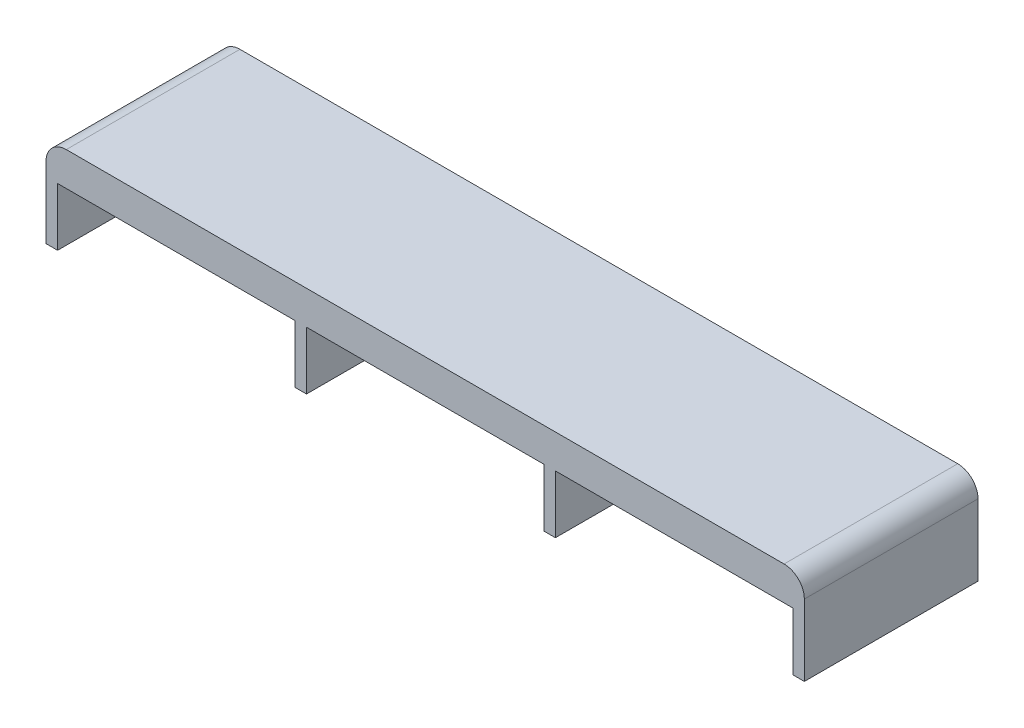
ISO-10303-21;
HEADER;
FILE_DESCRIPTION(('STEP AP214'),'2;1');
FILE_NAME('part.step','',(''),(''),'','','');
FILE_SCHEMA(('AUTOMOTIVE_DESIGN { 1 0 10303 214 1 1 1 1 }'));
ENDSEC;
DATA;
#1=APPLICATION_CONTEXT('core data for automotive mechanical design processes');
#2=APPLICATION_PROTOCOL_DEFINITION('international standard','automotive_design',2000,#1);
#3=PRODUCT_CONTEXT('',#1,'mechanical');
#4=PRODUCT('Part','Part','',(#3));
#5=PRODUCT_RELATED_PRODUCT_CATEGORY('part','',(#4));
#6=PRODUCT_DEFINITION_FORMATION('','',#4);
#7=PRODUCT_DEFINITION_CONTEXT('part definition',#1,'design');
#8=PRODUCT_DEFINITION('design','',#6,#7);
#9=PRODUCT_DEFINITION_SHAPE('','',#8);
#10=(LENGTH_UNIT() NAMED_UNIT(*) SI_UNIT(.MILLI.,.METRE.));
#11=(NAMED_UNIT(*) PLANE_ANGLE_UNIT() SI_UNIT($,.RADIAN.));
#12=(NAMED_UNIT(*) SI_UNIT($,.STERADIAN.) SOLID_ANGLE_UNIT());
#13=UNCERTAINTY_MEASURE_WITH_UNIT(LENGTH_MEASURE(1.E-05),#10,'distance_accuracy_value','');
#14=(GEOMETRIC_REPRESENTATION_CONTEXT(3) GLOBAL_UNCERTAINTY_ASSIGNED_CONTEXT((#13)) GLOBAL_UNIT_ASSIGNED_CONTEXT((#10,
#11,#12)) REPRESENTATION_CONTEXT('',''));
#15=CARTESIAN_POINT('',(0.,0.,0.));
#16=DIRECTION('',(0.,0.,1.));
#17=DIRECTION('',(1.,0.,0.));
#18=AXIS2_PLACEMENT_3D('',#15,#16,#17);
#19=CARTESIAN_POINT('',(-655.,-883.388792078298,150.));
#20=DIRECTION('',(-1.,0.,0.));
#21=DIRECTION('',(0.,-1.,0.));
#22=AXIS2_PLACEMENT_3D('',#19,#20,#21);
#23=PLANE('',#22);
#24=DIRECTION('',(0.,1.,0.));
#25=VECTOR('',#24,1.);
#26=CARTESIAN_POINT('',(-655.,-883.388792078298,150.));
#27=LINE('',#26,#25);
#28=CARTESIAN_POINT('',(-655.,-99.9999999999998,150.));
#29=VERTEX_POINT('',#28);
#30=CARTESIAN_POINT('',(-655.,23.2438816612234,150.));
#31=VERTEX_POINT('',#30);
#32=EDGE_CURVE('E166',#29,#31,#27,.T.);
#33=ORIENTED_EDGE('',*,*,#32,.T.);
#34=DIRECTION('',(0.,0.,-1.));
#35=VECTOR('',#34,1.);
#36=CARTESIAN_POINT('',(-655.,23.2438816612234,150.));
#37=LINE('',#36,#35);
#38=CARTESIAN_POINT('',(-655.,23.2438816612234,-150.));
#39=VERTEX_POINT('',#38);
#40=EDGE_CURVE('E172',#31,#39,#37,.T.);
#41=ORIENTED_EDGE('',*,*,#40,.T.);
#42=DIRECTION('',(0.,1.,0.));
#43=VECTOR('',#42,1.);
#44=CARTESIAN_POINT('',(-655.,-883.388792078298,-150.));
#45=LINE('',#44,#43);
#46=CARTESIAN_POINT('',(-655.,-99.9999999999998,-150.));
#47=VERTEX_POINT('',#46);
#48=EDGE_CURVE('E169',#47,#39,#45,.T.);
#49=ORIENTED_EDGE('',*,*,#48,.F.);
#50=DIRECTION('',(0.,0.,-1.));
#51=VECTOR('',#50,1.);
#52=CARTESIAN_POINT('',(-655.,-99.9999999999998,150.));
#53=LINE('',#52,#51);
#54=EDGE_CURVE('E162',#29,#47,#53,.T.);
#55=ORIENTED_EDGE('',*,*,#54,.F.);
#56=EDGE_LOOP('',(#33,#41,#49,#55));
#57=FACE_BOUND('',#56,.T.);
#58=ADVANCED_FACE('F36',(#57),#23,.T.);
#59=CARTESIAN_POINT('',(-3.94495462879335E-13,-99.9999999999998,150.));
#60=DIRECTION('',(0.,1.,0.));
#61=DIRECTION('',(0.,0.,1.));
#62=AXIS2_PLACEMENT_3D('',#59,#60,#61);
#63=PLANE('',#62);
#64=DIRECTION('',(1.,0.,0.));
#65=VECTOR('',#64,1.);
#66=CARTESIAN_POINT('',(-3.94495462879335E-13,-99.9999999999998,-150.));
#67=LINE('',#66,#65);
#68=CARTESIAN_POINT('',(-635.,-99.9999999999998,-150.));
#69=VERTEX_POINT('',#68);
#70=EDGE_CURVE('E219',#47,#69,#67,.T.);
#71=ORIENTED_EDGE('',*,*,#70,.T.);
#72=DIRECTION('',(0.,0.,-1.));
#73=VECTOR('',#72,1.);
#74=CARTESIAN_POINT('',(-635.,-99.9999999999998,150.));
#75=LINE('',#74,#73);
#76=CARTESIAN_POINT('',(-635.,-99.9999999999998,150.));
#77=VERTEX_POINT('',#76);
#78=EDGE_CURVE('E173',#77,#69,#75,.T.);
#79=ORIENTED_EDGE('',*,*,#78,.F.);
#80=DIRECTION('',(1.,0.,0.));
#81=VECTOR('',#80,1.);
#82=CARTESIAN_POINT('',(-3.94495462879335E-13,-99.9999999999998,150.));
#83=LINE('',#82,#81);
#84=EDGE_CURVE('E176',#29,#77,#83,.T.);
#85=ORIENTED_EDGE('',*,*,#84,.F.);
#86=ORIENTED_EDGE('',*,*,#54,.T.);
#87=EDGE_LOOP('',(#71,#79,#85,#86));
#88=FACE_BOUND('',#87,.T.);
#89=ADVANCED_FACE('F177',(#88),#63,.F.);
#90=CARTESIAN_POINT('',(-635.,-883.388792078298,150.));
#91=DIRECTION('',(-1.,0.,0.));
#92=DIRECTION('',(0.,0.,1.));
#93=AXIS2_PLACEMENT_3D('',#90,#91,#92);
#94=PLANE('',#93);
#95=DIRECTION('',(0.,1.,0.));
#96=VECTOR('',#95,1.);
#97=CARTESIAN_POINT('',(-635.,-883.388792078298,-150.));
#98=LINE('',#97,#96);
#99=CARTESIAN_POINT('',(-635.,2.22044604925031E-13,-150.));
#100=VERTEX_POINT('',#99);
#101=EDGE_CURVE('E221',#69,#100,#98,.T.);
#102=ORIENTED_EDGE('',*,*,#101,.T.);
#103=DIRECTION('',(0.,0.,-1.));
#104=VECTOR('',#103,1.);
#105=CARTESIAN_POINT('',(-635.,2.22044604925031E-13,150.));
#106=LINE('',#105,#104);
#107=CARTESIAN_POINT('',(-635.,2.22044604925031E-13,150.));
#108=VERTEX_POINT('',#107);
#109=EDGE_CURVE('E278',#108,#100,#106,.T.);
#110=ORIENTED_EDGE('',*,*,#109,.F.);
#111=DIRECTION('',(0.,1.,0.));
#112=VECTOR('',#111,1.);
#113=CARTESIAN_POINT('',(-635.,-883.388792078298,150.));
#114=LINE('',#113,#112);
#115=EDGE_CURVE('E180',#77,#108,#114,.T.);
#116=ORIENTED_EDGE('',*,*,#115,.F.);
#117=ORIENTED_EDGE('',*,*,#78,.T.);
#118=EDGE_LOOP('',(#102,#110,#116,#117));
#119=FACE_BOUND('',#118,.T.);
#120=ADVANCED_FACE('F304',(#119),#94,.F.);
#121=CARTESIAN_POINT('',(0.,-1.11022302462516E-13,150.));
#122=DIRECTION('',(0.,1.,0.));
#123=DIRECTION('',(-1.,0.,0.));
#124=AXIS2_PLACEMENT_3D('',#121,#122,#123);
#125=PLANE('',#124);
#126=DIRECTION('',(1.,0.,0.));
#127=VECTOR('',#126,1.);
#128=CARTESIAN_POINT('',(0.,-1.11022302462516E-13,-150.));
#129=LINE('',#128,#127);
#130=CARTESIAN_POINT('',(-225.,0.,-150.));
#131=VERTEX_POINT('',#130);
#132=EDGE_CURVE('E223',#100,#131,#129,.T.);
#133=ORIENTED_EDGE('',*,*,#132,.T.);
#134=DIRECTION('',(0.,0.,-1.));
#135=VECTOR('',#134,1.);
#136=CARTESIAN_POINT('',(-225.,0.,150.));
#137=LINE('',#136,#135);
#138=CARTESIAN_POINT('',(-225.,0.,150.));
#139=VERTEX_POINT('',#138);
#140=EDGE_CURVE('E275',#139,#131,#137,.T.);
#141=ORIENTED_EDGE('',*,*,#140,.F.);
#142=DIRECTION('',(1.,0.,0.));
#143=VECTOR('',#142,1.);
#144=CARTESIAN_POINT('',(0.,-1.11022302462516E-13,150.));
#145=LINE('',#144,#143);
#146=EDGE_CURVE('E191',#108,#139,#145,.T.);
#147=ORIENTED_EDGE('',*,*,#146,.F.);
#148=ORIENTED_EDGE('',*,*,#109,.T.);
#149=EDGE_LOOP('',(#133,#141,#147,#148));
#150=FACE_BOUND('',#149,.T.);
#151=ADVANCED_FACE('F311',(#150),#125,.F.);
#152=CARTESIAN_POINT('',(-225.,-883.388792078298,150.));
#153=DIRECTION('',(1.,0.,0.));
#154=DIRECTION('',(0.,0.,-1.));
#155=AXIS2_PLACEMENT_3D('',#152,#153,#154);
#156=PLANE('',#155);
#157=DIRECTION('',(0.,-1.,0.));
#158=VECTOR('',#157,1.);
#159=CARTESIAN_POINT('',(-225.,-883.388792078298,-150.));
#160=LINE('',#159,#158);
#161=CARTESIAN_POINT('',(-225.,-100.,-150.));
#162=VERTEX_POINT('',#161);
#163=EDGE_CURVE('E225',#131,#162,#160,.T.);
#164=ORIENTED_EDGE('',*,*,#163,.T.);
#165=DIRECTION('',(0.,0.,-1.));
#166=VECTOR('',#165,1.);
#167=CARTESIAN_POINT('',(-225.,-100.,150.));
#168=LINE('',#167,#166);
#169=CARTESIAN_POINT('',(-225.,-100.,150.));
#170=VERTEX_POINT('',#169);
#171=EDGE_CURVE('E272',#170,#162,#168,.T.);
#172=ORIENTED_EDGE('',*,*,#171,.F.);
#173=DIRECTION('',(0.,-1.,0.));
#174=VECTOR('',#173,1.);
#175=CARTESIAN_POINT('',(-225.,-883.388792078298,150.));
#176=LINE('',#175,#174);
#177=EDGE_CURVE('E193',#139,#170,#176,.T.);
#178=ORIENTED_EDGE('',*,*,#177,.F.);
#179=ORIENTED_EDGE('',*,*,#140,.T.);
#180=EDGE_LOOP('',(#164,#172,#178,#179));
#181=FACE_BOUND('',#180,.T.);
#182=ADVANCED_FACE('F314',(#181),#156,.F.);
#183=CARTESIAN_POINT('',(-3.94495462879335E-13,-100.,150.));
#184=DIRECTION('',(0.,1.,0.));
#185=DIRECTION('',(0.,0.,1.));
#186=AXIS2_PLACEMENT_3D('',#183,#184,#185);
#187=PLANE('',#186);
#188=DIRECTION('',(1.,0.,0.));
#189=VECTOR('',#188,1.);
#190=CARTESIAN_POINT('',(-3.94495462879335E-13,-100.,-150.));
#191=LINE('',#190,#189);
#192=CARTESIAN_POINT('',(-205.,-100.,-150.));
#193=VERTEX_POINT('',#192);
#194=EDGE_CURVE('E227',#162,#193,#191,.T.);
#195=ORIENTED_EDGE('',*,*,#194,.T.);
#196=DIRECTION('',(0.,0.,-1.));
#197=VECTOR('',#196,1.);
#198=CARTESIAN_POINT('',(-205.,-100.,150.));
#199=LINE('',#198,#197);
#200=CARTESIAN_POINT('',(-205.,-100.,150.));
#201=VERTEX_POINT('',#200);
#202=EDGE_CURVE('E269',#201,#193,#199,.T.);
#203=ORIENTED_EDGE('',*,*,#202,.F.);
#204=DIRECTION('',(1.,0.,0.));
#205=VECTOR('',#204,1.);
#206=CARTESIAN_POINT('',(-3.94495462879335E-13,-100.,150.));
#207=LINE('',#206,#205);
#208=EDGE_CURVE('E195',#170,#201,#207,.T.);
#209=ORIENTED_EDGE('',*,*,#208,.F.);
#210=ORIENTED_EDGE('',*,*,#171,.T.);
#211=EDGE_LOOP('',(#195,#203,#209,#210));
#212=FACE_BOUND('',#211,.T.);
#213=ADVANCED_FACE('F319',(#212),#187,.F.);
#214=CARTESIAN_POINT('',(-205.,-883.388792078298,150.));
#215=DIRECTION('',(-1.,0.,0.));
#216=DIRECTION('',(0.,0.,1.));
#217=AXIS2_PLACEMENT_3D('',#214,#215,#216);
#218=PLANE('',#217);
#219=DIRECTION('',(0.,1.,0.));
#220=VECTOR('',#219,1.);
#221=CARTESIAN_POINT('',(-205.,-883.388792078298,-150.));
#222=LINE('',#221,#220);
#223=CARTESIAN_POINT('',(-205.,0.,-150.));
#224=VERTEX_POINT('',#223);
#225=EDGE_CURVE('E229',#193,#224,#222,.T.);
#226=ORIENTED_EDGE('',*,*,#225,.T.);
#227=DIRECTION('',(0.,0.,-1.));
#228=VECTOR('',#227,1.);
#229=CARTESIAN_POINT('',(-205.,0.,150.));
#230=LINE('',#229,#228);
#231=CARTESIAN_POINT('',(-205.,0.,150.));
#232=VERTEX_POINT('',#231);
#233=EDGE_CURVE('E266',#232,#224,#230,.T.);
#234=ORIENTED_EDGE('',*,*,#233,.F.);
#235=DIRECTION('',(0.,1.,0.));
#236=VECTOR('',#235,1.);
#237=CARTESIAN_POINT('',(-205.,-883.388792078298,150.));
#238=LINE('',#237,#236);
#239=EDGE_CURVE('E197',#201,#232,#238,.T.);
#240=ORIENTED_EDGE('',*,*,#239,.F.);
#241=ORIENTED_EDGE('',*,*,#202,.T.);
#242=EDGE_LOOP('',(#226,#234,#240,#241));
#243=FACE_BOUND('',#242,.T.);
#244=ADVANCED_FACE('F325',(#243),#218,.F.);
#245=CARTESIAN_POINT('',(-3.94495462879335E-13,0.,150.));
#246=DIRECTION('',(0.,1.,0.));
#247=DIRECTION('',(0.,0.,1.));
#248=AXIS2_PLACEMENT_3D('',#245,#246,#247);
#249=PLANE('',#248);
#250=DIRECTION('',(1.,0.,0.));
#251=VECTOR('',#250,1.);
#252=CARTESIAN_POINT('',(-3.94495462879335E-13,0.,-150.));
#253=LINE('',#252,#251);
#254=CARTESIAN_POINT('',(205.,0.,-150.));
#255=VERTEX_POINT('',#254);
#256=EDGE_CURVE('E231',#224,#255,#253,.T.);
#257=ORIENTED_EDGE('',*,*,#256,.T.);
#258=DIRECTION('',(0.,0.,-1.));
#259=VECTOR('',#258,1.);
#260=CARTESIAN_POINT('',(205.,0.,150.));
#261=LINE('',#260,#259);
#262=CARTESIAN_POINT('',(205.,0.,150.));
#263=VERTEX_POINT('',#262);
#264=EDGE_CURVE('E263',#263,#255,#261,.T.);
#265=ORIENTED_EDGE('',*,*,#264,.F.);
#266=DIRECTION('',(1.,0.,0.));
#267=VECTOR('',#266,1.);
#268=CARTESIAN_POINT('',(-3.94495462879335E-13,0.,150.));
#269=LINE('',#268,#267);
#270=EDGE_CURVE('E199',#232,#263,#269,.T.);
#271=ORIENTED_EDGE('',*,*,#270,.F.);
#272=ORIENTED_EDGE('',*,*,#233,.T.);
#273=EDGE_LOOP('',(#257,#265,#271,#272));
#274=FACE_BOUND('',#273,.T.);
#275=ADVANCED_FACE('F329',(#274),#249,.F.);
#276=CARTESIAN_POINT('',(205.,-883.388792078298,150.));
#277=DIRECTION('',(1.,0.,0.));
#278=DIRECTION('',(0.,0.,-1.));
#279=AXIS2_PLACEMENT_3D('',#276,#277,#278);
#280=PLANE('',#279);
#281=DIRECTION('',(0.,-1.,0.));
#282=VECTOR('',#281,1.);
#283=CARTESIAN_POINT('',(205.,-883.388792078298,-150.));
#284=LINE('',#283,#282);
#285=CARTESIAN_POINT('',(205.,-100.,-150.));
#286=VERTEX_POINT('',#285);
#287=EDGE_CURVE('E233',#255,#286,#284,.T.);
#288=ORIENTED_EDGE('',*,*,#287,.T.);
#289=DIRECTION('',(0.,0.,-1.));
#290=VECTOR('',#289,1.);
#291=CARTESIAN_POINT('',(205.,-100.,150.));
#292=LINE('',#291,#290);
#293=CARTESIAN_POINT('',(205.,-100.,150.));
#294=VERTEX_POINT('',#293);
#295=EDGE_CURVE('E260',#294,#286,#292,.T.);
#296=ORIENTED_EDGE('',*,*,#295,.F.);
#297=DIRECTION('',(0.,-1.,0.));
#298=VECTOR('',#297,1.);
#299=CARTESIAN_POINT('',(205.,-883.388792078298,150.));
#300=LINE('',#299,#298);
#301=EDGE_CURVE('E201',#263,#294,#300,.T.);
#302=ORIENTED_EDGE('',*,*,#301,.F.);
#303=ORIENTED_EDGE('',*,*,#264,.T.);
#304=EDGE_LOOP('',(#288,#296,#302,#303));
#305=FACE_BOUND('',#304,.T.);
#306=ADVANCED_FACE('F334',(#305),#280,.F.);
#307=CARTESIAN_POINT('',(-3.94495462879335E-13,-100.,150.));
#308=DIRECTION('',(0.,1.,0.));
#309=DIRECTION('',(0.,0.,1.));
#310=AXIS2_PLACEMENT_3D('',#307,#308,#309);
#311=PLANE('',#310);
#312=DIRECTION('',(1.,0.,0.));
#313=VECTOR('',#312,1.);
#314=CARTESIAN_POINT('',(-3.94495462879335E-13,-100.,-150.));
#315=LINE('',#314,#313);
#316=CARTESIAN_POINT('',(225.,-100.,-150.));
#317=VERTEX_POINT('',#316);
#318=EDGE_CURVE('E235',#286,#317,#315,.T.);
#319=ORIENTED_EDGE('',*,*,#318,.T.);
#320=DIRECTION('',(0.,0.,-1.));
#321=VECTOR('',#320,1.);
#322=CARTESIAN_POINT('',(225.,-100.,150.));
#323=LINE('',#322,#321);
#324=CARTESIAN_POINT('',(225.,-100.,150.));
#325=VERTEX_POINT('',#324);
#326=EDGE_CURVE('E257',#325,#317,#323,.T.);
#327=ORIENTED_EDGE('',*,*,#326,.F.);
#328=DIRECTION('',(1.,0.,0.));
#329=VECTOR('',#328,1.);
#330=CARTESIAN_POINT('',(-3.94495462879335E-13,-100.,150.));
#331=LINE('',#330,#329);
#332=EDGE_CURVE('E203',#294,#325,#331,.T.);
#333=ORIENTED_EDGE('',*,*,#332,.F.);
#334=ORIENTED_EDGE('',*,*,#295,.T.);
#335=EDGE_LOOP('',(#319,#327,#333,#334));
#336=FACE_BOUND('',#335,.T.);
#337=ADVANCED_FACE('F340',(#336),#311,.F.);
#338=CARTESIAN_POINT('',(225.,-883.388792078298,150.));
#339=DIRECTION('',(-1.,0.,0.));
#340=DIRECTION('',(0.,0.,1.));
#341=AXIS2_PLACEMENT_3D('',#338,#339,#340);
#342=PLANE('',#341);
#343=DIRECTION('',(0.,1.,0.));
#344=VECTOR('',#343,1.);
#345=CARTESIAN_POINT('',(225.,-883.388792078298,-150.));
#346=LINE('',#345,#344);
#347=CARTESIAN_POINT('',(225.,0.,-150.));
#348=VERTEX_POINT('',#347);
#349=EDGE_CURVE('E237',#317,#348,#346,.T.);
#350=ORIENTED_EDGE('',*,*,#349,.T.);
#351=DIRECTION('',(0.,0.,-1.));
#352=VECTOR('',#351,1.);
#353=CARTESIAN_POINT('',(225.,0.,150.));
#354=LINE('',#353,#352);
#355=CARTESIAN_POINT('',(225.,0.,150.));
#356=VERTEX_POINT('',#355);
#357=EDGE_CURVE('E254',#356,#348,#354,.T.);
#358=ORIENTED_EDGE('',*,*,#357,.F.);
#359=DIRECTION('',(0.,1.,0.));
#360=VECTOR('',#359,1.);
#361=CARTESIAN_POINT('',(225.,-883.388792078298,150.));
#362=LINE('',#361,#360);
#363=EDGE_CURVE('E205',#325,#356,#362,.T.);
#364=ORIENTED_EDGE('',*,*,#363,.F.);
#365=ORIENTED_EDGE('',*,*,#326,.T.);
#366=EDGE_LOOP('',(#350,#358,#364,#365));
#367=FACE_BOUND('',#366,.T.);
#368=ADVANCED_FACE('F344',(#367),#342,.F.);
#369=CARTESIAN_POINT('',(-3.94495462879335E-13,0.,150.));
#370=DIRECTION('',(0.,1.,0.));
#371=DIRECTION('',(0.,0.,1.));
#372=AXIS2_PLACEMENT_3D('',#369,#370,#371);
#373=PLANE('',#372);
#374=DIRECTION('',(1.,0.,0.));
#375=VECTOR('',#374,1.);
#376=CARTESIAN_POINT('',(-3.94495462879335E-13,0.,-150.));
#377=LINE('',#376,#375);
#378=CARTESIAN_POINT('',(635.,0.,-150.));
#379=VERTEX_POINT('',#378);
#380=EDGE_CURVE('E239',#348,#379,#377,.T.);
#381=ORIENTED_EDGE('',*,*,#380,.T.);
#382=DIRECTION('',(0.,0.,-1.));
#383=VECTOR('',#382,1.);
#384=CARTESIAN_POINT('',(635.,0.,150.));
#385=LINE('',#384,#383);
#386=CARTESIAN_POINT('',(635.,0.,150.));
#387=VERTEX_POINT('',#386);
#388=EDGE_CURVE('E251',#387,#379,#385,.T.);
#389=ORIENTED_EDGE('',*,*,#388,.F.);
#390=DIRECTION('',(1.,0.,0.));
#391=VECTOR('',#390,1.);
#392=CARTESIAN_POINT('',(-3.94495462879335E-13,0.,150.));
#393=LINE('',#392,#391);
#394=EDGE_CURVE('E207',#356,#387,#393,.T.);
#395=ORIENTED_EDGE('',*,*,#394,.F.);
#396=ORIENTED_EDGE('',*,*,#357,.T.);
#397=EDGE_LOOP('',(#381,#389,#395,#396));
#398=FACE_BOUND('',#397,.T.);
#399=ADVANCED_FACE('F349',(#398),#373,.F.);
#400=CARTESIAN_POINT('',(635.,-883.388792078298,150.));
#401=DIRECTION('',(1.,0.,0.));
#402=DIRECTION('',(0.,0.,-1.));
#403=AXIS2_PLACEMENT_3D('',#400,#401,#402);
#404=PLANE('',#403);
#405=DIRECTION('',(0.,-1.,0.));
#406=VECTOR('',#405,1.);
#407=CARTESIAN_POINT('',(635.,-883.388792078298,-150.));
#408=LINE('',#407,#406);
#409=CARTESIAN_POINT('',(635.,-100.,-150.));
#410=VERTEX_POINT('',#409);
#411=EDGE_CURVE('E241',#379,#410,#408,.T.);
#412=ORIENTED_EDGE('',*,*,#411,.T.);
#413=DIRECTION('',(0.,0.,-1.));
#414=VECTOR('',#413,1.);
#415=CARTESIAN_POINT('',(635.,-100.,150.));
#416=LINE('',#415,#414);
#417=CARTESIAN_POINT('',(635.,-100.,150.));
#418=VERTEX_POINT('',#417);
#419=EDGE_CURVE('E248',#418,#410,#416,.T.);
#420=ORIENTED_EDGE('',*,*,#419,.F.);
#421=DIRECTION('',(0.,-1.,0.));
#422=VECTOR('',#421,1.);
#423=CARTESIAN_POINT('',(635.,-883.388792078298,150.));
#424=LINE('',#423,#422);
#425=EDGE_CURVE('E209',#387,#418,#424,.T.);
#426=ORIENTED_EDGE('',*,*,#425,.F.);
#427=ORIENTED_EDGE('',*,*,#388,.T.);
#428=EDGE_LOOP('',(#412,#420,#426,#427));
#429=FACE_BOUND('',#428,.T.);
#430=ADVANCED_FACE('F355',(#429),#404,.F.);
#431=CARTESIAN_POINT('',(-3.94495462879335E-13,-100.,150.));
#432=DIRECTION('',(0.,1.,0.));
#433=DIRECTION('',(0.,0.,1.));
#434=AXIS2_PLACEMENT_3D('',#431,#432,#433);
#435=PLANE('',#434);
#436=DIRECTION('',(1.,0.,0.));
#437=VECTOR('',#436,1.);
#438=CARTESIAN_POINT('',(-3.94495462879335E-13,-100.,-150.));
#439=LINE('',#438,#437);
#440=CARTESIAN_POINT('',(654.999999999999,-100.,-150.));
#441=VERTEX_POINT('',#440);
#442=EDGE_CURVE('E243',#410,#441,#439,.T.);
#443=ORIENTED_EDGE('',*,*,#442,.T.);
#444=DIRECTION('',(0.,0.,-1.));
#445=VECTOR('',#444,1.);
#446=CARTESIAN_POINT('',(654.999999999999,-100.,150.));
#447=LINE('',#446,#445);
#448=CARTESIAN_POINT('',(654.999999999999,-100.,150.));
#449=VERTEX_POINT('',#448);
#450=EDGE_CURVE('E217',#449,#441,#447,.T.);
#451=ORIENTED_EDGE('',*,*,#450,.F.);
#452=DIRECTION('',(1.,0.,0.));
#453=VECTOR('',#452,1.);
#454=CARTESIAN_POINT('',(-3.94495462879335E-13,-100.,150.));
#455=LINE('',#454,#453);
#456=EDGE_CURVE('E211',#418,#449,#455,.T.);
#457=ORIENTED_EDGE('',*,*,#456,.F.);
#458=ORIENTED_EDGE('',*,*,#419,.T.);
#459=EDGE_LOOP('',(#443,#451,#457,#458));
#460=FACE_BOUND('',#459,.T.);
#461=ADVANCED_FACE('F359',(#460),#435,.F.);
#462=CARTESIAN_POINT('',(654.999999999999,-883.388792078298,150.));
#463=DIRECTION('',(-1.,0.,0.));
#464=DIRECTION('',(0.,0.,1.));
#465=AXIS2_PLACEMENT_3D('',#462,#463,#464);
#466=PLANE('',#465);
#467=DIRECTION('',(0.,1.,0.));
#468=VECTOR('',#467,1.);
#469=CARTESIAN_POINT('',(654.999999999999,-883.388792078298,-150.));
#470=LINE('',#469,#468);
#471=CARTESIAN_POINT('',(654.999999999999,23.2438816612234,-150.));
#472=VERTEX_POINT('',#471);
#473=EDGE_CURVE('E187',#441,#472,#470,.T.);
#474=ORIENTED_EDGE('',*,*,#473,.T.);
#475=DIRECTION('',(0.,0.,-1.));
#476=VECTOR('',#475,1.);
#477=CARTESIAN_POINT('',(654.999999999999,23.2438816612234,150.));
#478=LINE('',#477,#476);
#479=CARTESIAN_POINT('',(654.999999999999,23.2438816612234,150.));
#480=VERTEX_POINT('',#479);
#481=EDGE_CURVE('E11',#472,#480,#478,.F.);
#482=ORIENTED_EDGE('',*,*,#481,.T.);
#483=DIRECTION('',(0.,1.,0.));
#484=VECTOR('',#483,1.);
#485=CARTESIAN_POINT('',(654.999999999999,-883.388792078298,150.));
#486=LINE('',#485,#484);
#487=EDGE_CURVE('E213',#449,#480,#486,.T.);
#488=ORIENTED_EDGE('',*,*,#487,.F.);
#489=ORIENTED_EDGE('',*,*,#450,.T.);
#490=EDGE_LOOP('',(#474,#482,#488,#489));
#491=FACE_BOUND('',#490,.T.);
#492=ADVANCED_FACE('F361',(#491),#466,.F.);
#493=CARTESIAN_POINT('',(-3.94495462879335E-13,58.2438816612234,150.));
#494=DIRECTION('',(0.,1.,0.));
#495=DIRECTION('',(0.,0.,1.));
#496=AXIS2_PLACEMENT_3D('',#493,#494,#495);
#497=PLANE('',#496);
#498=DIRECTION('',(1.,0.,0.));
#499=VECTOR('',#498,1.);
#500=CARTESIAN_POINT('',(-3.94495462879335E-13,58.2438816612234,-150.));
#501=LINE('',#500,#499);
#502=CARTESIAN_POINT('',(-620.,58.2438816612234,-150.));
#503=VERTEX_POINT('',#502);
#504=CARTESIAN_POINT('',(619.999999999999,58.2438816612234,-150.));
#505=VERTEX_POINT('',#504);
#506=EDGE_CURVE('E184',#503,#505,#501,.T.);
#507=ORIENTED_EDGE('',*,*,#506,.F.);
#508=DIRECTION('',(0.,0.,-1.));
#509=VECTOR('',#508,1.);
#510=CARTESIAN_POINT('',(-620.,58.2438816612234,150.));
#511=LINE('',#510,#509);
#512=CARTESIAN_POINT('',(-620.,58.2438816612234,150.));
#513=VERTEX_POINT('',#512);
#514=EDGE_CURVE('E290',#503,#513,#511,.F.);
#515=ORIENTED_EDGE('',*,*,#514,.T.);
#516=DIRECTION('',(1.,0.,0.));
#517=VECTOR('',#516,1.);
#518=CARTESIAN_POINT('',(-3.94495462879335E-13,58.2438816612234,150.));
#519=LINE('',#518,#517);
#520=CARTESIAN_POINT('',(619.999999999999,58.2438816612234,150.));
#521=VERTEX_POINT('',#520);
#522=EDGE_CURVE('E215',#513,#521,#519,.T.);
#523=ORIENTED_EDGE('',*,*,#522,.T.);
#524=DIRECTION('',(0.,0.,-1.));
#525=VECTOR('',#524,1.);
#526=CARTESIAN_POINT('',(619.999999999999,58.2438816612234,-150.));
#527=LINE('',#526,#525);
#528=EDGE_CURVE('E287',#521,#505,#527,.T.);
#529=ORIENTED_EDGE('',*,*,#528,.T.);
#530=EDGE_LOOP('',(#507,#515,#523,#529));
#531=FACE_BOUND('',#530,.T.);
#532=ADVANCED_FACE('F295',(#531),#497,.T.);
#533=CARTESIAN_POINT('',(-3.94495462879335E-13,-883.388792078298,150.));
#534=DIRECTION('',(0.,0.,1.));
#535=DIRECTION('',(1.,0.,0.));
#536=AXIS2_PLACEMENT_3D('',#533,#534,#535);
#537=PLANE('',#536);
#538=ORIENTED_EDGE('',*,*,#522,.F.);
#539=CARTESIAN_POINT('',(-620.,23.2438816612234,150.));
#540=DIRECTION('',(0.,0.,1.));
#541=DIRECTION('',(1.,0.,0.));
#542=AXIS2_PLACEMENT_3D('',#539,#540,#541);
#543=CIRCLE('',#542,35.);
#544=EDGE_CURVE('E44',#513,#31,#543,.T.);
#545=ORIENTED_EDGE('',*,*,#544,.T.);
#546=ORIENTED_EDGE('',*,*,#32,.F.);
#547=ORIENTED_EDGE('',*,*,#84,.T.);
#548=ORIENTED_EDGE('',*,*,#115,.T.);
#549=ORIENTED_EDGE('',*,*,#146,.T.);
#550=ORIENTED_EDGE('',*,*,#177,.T.);
#551=ORIENTED_EDGE('',*,*,#208,.T.);
#552=ORIENTED_EDGE('',*,*,#239,.T.);
#553=ORIENTED_EDGE('',*,*,#270,.T.);
#554=ORIENTED_EDGE('',*,*,#301,.T.);
#555=ORIENTED_EDGE('',*,*,#332,.T.);
#556=ORIENTED_EDGE('',*,*,#363,.T.);
#557=ORIENTED_EDGE('',*,*,#394,.T.);
#558=ORIENTED_EDGE('',*,*,#425,.T.);
#559=ORIENTED_EDGE('',*,*,#456,.T.);
#560=ORIENTED_EDGE('',*,*,#487,.T.);
#561=CARTESIAN_POINT('',(619.999999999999,23.2438816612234,150.));
#562=DIRECTION('',(0.,0.,1.));
#563=DIRECTION('',(1.,0.,0.));
#564=AXIS2_PLACEMENT_3D('',#561,#562,#563);
#565=CIRCLE('',#564,35.);
#566=EDGE_CURVE('E56',#480,#521,#565,.T.);
#567=ORIENTED_EDGE('',*,*,#566,.T.);
#568=EDGE_LOOP('',(#538,#545,#546,#547,#548,#549,#550,#551,#552,#553,#554,#555,#556,#557,#558,
#559,#560,#567));
#569=FACE_BOUND('',#568,.T.);
#570=ADVANCED_FACE('F182',(#569),#537,.T.);
#571=CARTESIAN_POINT('',(-3.94495462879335E-13,-883.388792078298,-150.));
#572=DIRECTION('',(0.,0.,1.));
#573=DIRECTION('',(1.,0.,0.));
#574=AXIS2_PLACEMENT_3D('',#571,#572,#573);
#575=PLANE('',#574);
#576=ORIENTED_EDGE('',*,*,#48,.T.);
#577=CARTESIAN_POINT('',(-620.,23.2438816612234,-150.));
#578=DIRECTION('',(0.,0.,1.));
#579=DIRECTION('',(1.,0.,0.));
#580=AXIS2_PLACEMENT_3D('',#577,#578,#579);
#581=CIRCLE('',#580,35.);
#582=EDGE_CURVE('E285',#39,#503,#581,.F.);
#583=ORIENTED_EDGE('',*,*,#582,.T.);
#584=ORIENTED_EDGE('',*,*,#506,.T.);
#585=CARTESIAN_POINT('',(619.999999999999,23.2438816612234,-150.));
#586=DIRECTION('',(0.,0.,1.));
#587=DIRECTION('',(1.,0.,0.));
#588=AXIS2_PLACEMENT_3D('',#585,#586,#587);
#589=CIRCLE('',#588,35.);
#590=EDGE_CURVE('E283',#505,#472,#589,.F.);
#591=ORIENTED_EDGE('',*,*,#590,.T.);
#592=ORIENTED_EDGE('',*,*,#473,.F.);
#593=ORIENTED_EDGE('',*,*,#442,.F.);
#594=ORIENTED_EDGE('',*,*,#411,.F.);
#595=ORIENTED_EDGE('',*,*,#380,.F.);
#596=ORIENTED_EDGE('',*,*,#349,.F.);
#597=ORIENTED_EDGE('',*,*,#318,.F.);
#598=ORIENTED_EDGE('',*,*,#287,.F.);
#599=ORIENTED_EDGE('',*,*,#256,.F.);
#600=ORIENTED_EDGE('',*,*,#225,.F.);
#601=ORIENTED_EDGE('',*,*,#194,.F.);
#602=ORIENTED_EDGE('',*,*,#163,.F.);
#603=ORIENTED_EDGE('',*,*,#132,.F.);
#604=ORIENTED_EDGE('',*,*,#101,.F.);
#605=ORIENTED_EDGE('',*,*,#70,.F.);
#606=EDGE_LOOP('',(#576,#583,#584,#591,#592,#593,#594,#595,#596,#597,#598,#599,#600,#601,#602,
#603,#604,#605));
#607=FACE_BOUND('',#606,.T.);
#608=ADVANCED_FACE('F300',(#607),#575,.F.);
#609=CARTESIAN_POINT('',(-620.,23.2438816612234,150.));
#610=DIRECTION('',(0.,0.,-1.));
#611=DIRECTION('',(-1.,0.,0.));
#612=AXIS2_PLACEMENT_3D('',#609,#610,#611);
#613=CYLINDRICAL_SURFACE('',#612,35.);
#614=ORIENTED_EDGE('',*,*,#544,.F.);
#615=ORIENTED_EDGE('',*,*,#514,.F.);
#616=ORIENTED_EDGE('',*,*,#582,.F.);
#617=ORIENTED_EDGE('',*,*,#40,.F.);
#618=EDGE_LOOP('',(#614,#615,#616,#617));
#619=FACE_BOUND('',#618,.T.);
#620=ADVANCED_FACE('F298',(#619),#613,.T.);
#621=CARTESIAN_POINT('',(619.999999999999,23.2438816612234,150.));
#622=DIRECTION('',(0.,0.,1.));
#623=DIRECTION('',(1.,0.,0.));
#624=AXIS2_PLACEMENT_3D('',#621,#622,#623);
#625=CYLINDRICAL_SURFACE('',#624,35.);
#626=ORIENTED_EDGE('',*,*,#566,.F.);
#627=ORIENTED_EDGE('',*,*,#481,.F.);
#628=ORIENTED_EDGE('',*,*,#590,.F.);
#629=ORIENTED_EDGE('',*,*,#528,.F.);
#630=EDGE_LOOP('',(#626,#627,#628,#629));
#631=FACE_BOUND('',#630,.T.);
#632=ADVANCED_FACE('F38',(#631),#625,.T.);
#633=CLOSED_SHELL('',(#58,#89,#120,#151,#182,#213,#244,#275,#306,#337,#368,#399,#430,#461,#492,
#532,#570,#608,#620,#632));
#634=MANIFOLD_SOLID_BREP('B2',#633);
#635=ADVANCED_BREP_SHAPE_REPRESENTATION('',(#18,#634),#14);
#636=SHAPE_DEFINITION_REPRESENTATION(#9,#635);
ENDSEC;
END-ISO-10303-21;
